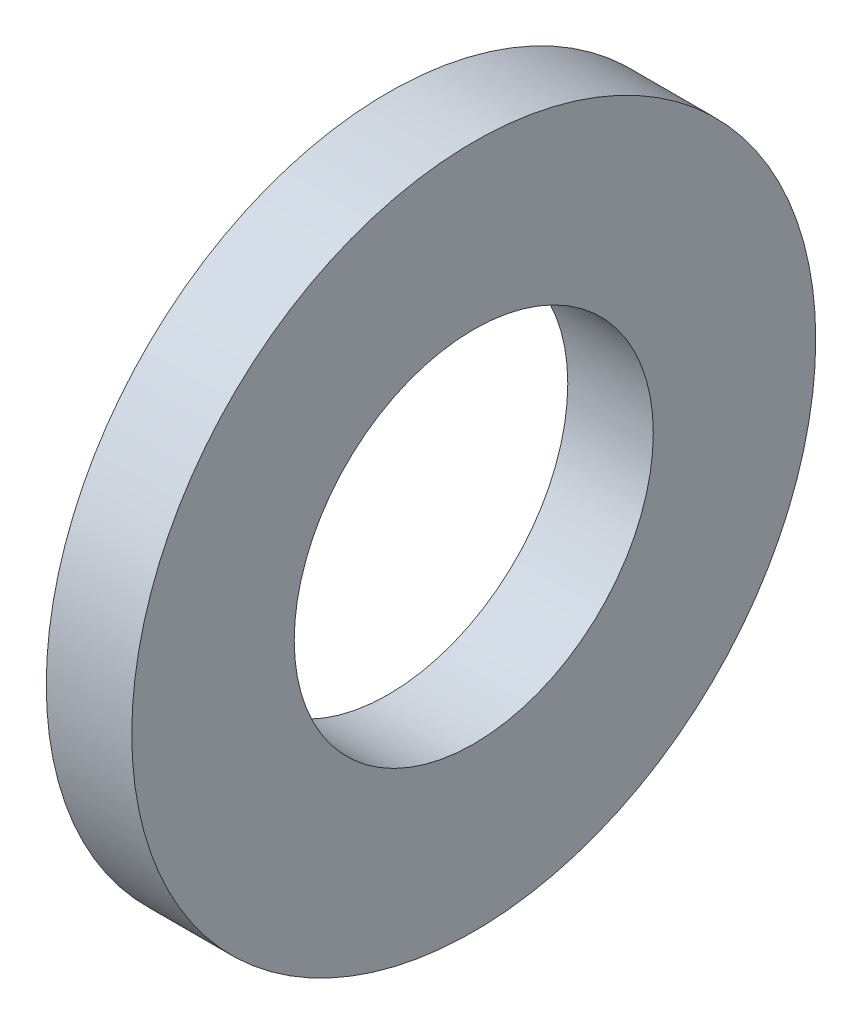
ISO-10303-21;
HEADER;
FILE_DESCRIPTION(('STEP AP214'),'2;1');
FILE_NAME('part.step','',(''),(''),'','','');
FILE_SCHEMA(('AUTOMOTIVE_DESIGN { 1 0 10303 214 1 1 1 1 }'));
ENDSEC;
DATA;
#1=APPLICATION_CONTEXT('core data for automotive mechanical design processes');
#2=APPLICATION_PROTOCOL_DEFINITION('international standard','automotive_design',2000,#1);
#3=PRODUCT_CONTEXT('',#1,'mechanical');
#4=PRODUCT('Part','Part','',(#3));
#5=PRODUCT_RELATED_PRODUCT_CATEGORY('part','',(#4));
#6=PRODUCT_DEFINITION_FORMATION('','',#4);
#7=PRODUCT_DEFINITION_CONTEXT('part definition',#1,'design');
#8=PRODUCT_DEFINITION('design','',#6,#7);
#9=PRODUCT_DEFINITION_SHAPE('','',#8);
#10=(LENGTH_UNIT() NAMED_UNIT(*) SI_UNIT(.MILLI.,.METRE.));
#11=(NAMED_UNIT(*) PLANE_ANGLE_UNIT() SI_UNIT($,.RADIAN.));
#12=(NAMED_UNIT(*) SI_UNIT($,.STERADIAN.) SOLID_ANGLE_UNIT());
#13=UNCERTAINTY_MEASURE_WITH_UNIT(LENGTH_MEASURE(1.E-05),#10,'distance_accuracy_value','');
#14=(GEOMETRIC_REPRESENTATION_CONTEXT(3) GLOBAL_UNCERTAINTY_ASSIGNED_CONTEXT((#13)) GLOBAL_UNIT_ASSIGNED_CONTEXT((#10,
#11,#12)) REPRESENTATION_CONTEXT('',''));
#15=CARTESIAN_POINT('',(0.,0.,0.));
#16=DIRECTION('',(0.,0.,1.));
#17=DIRECTION('',(1.,0.,0.));
#18=AXIS2_PLACEMENT_3D('',#15,#16,#17);
#19=CARTESIAN_POINT('',(-7.4558363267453,0.,0.));
#20=DIRECTION('',(-1.,0.,0.));
#21=DIRECTION('',(0.,0.,1.));
#22=AXIS2_PLACEMENT_3D('',#19,#20,#21);
#23=CYLINDRICAL_SURFACE('',#22,4.20000000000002);
#24=CARTESIAN_POINT('',(2.,0.,0.));
#25=DIRECTION('',(-1.,0.,0.));
#26=DIRECTION('',(0.,0.,1.));
#27=AXIS2_PLACEMENT_3D('',#24,#25,#26);
#28=CIRCLE('',#27,4.20000000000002);
#29=CARTESIAN_POINT('',(2.,0.,4.20000000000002));
#30=VERTEX_POINT('',#29);
#31=EDGE_CURVE('E10',#30,#30,#28,.T.);
#32=ORIENTED_EDGE('',*,*,#31,.F.);
#33=EDGE_LOOP('',(#32));
#34=FACE_BOUND('',#33,.T.);
#35=CARTESIAN_POINT('',(0.,0.,0.));
#36=DIRECTION('',(-1.,0.,0.));
#37=DIRECTION('',(0.,0.,1.));
#38=AXIS2_PLACEMENT_3D('',#35,#36,#37);
#39=CIRCLE('',#38,4.20000000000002);
#40=CARTESIAN_POINT('',(0.,0.,4.20000000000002));
#41=VERTEX_POINT('',#40);
#42=EDGE_CURVE('E43',#41,#41,#39,.T.);
#43=ORIENTED_EDGE('',*,*,#42,.T.);
#44=EDGE_LOOP('',(#43));
#45=FACE_BOUND('',#44,.T.);
#46=ADVANCED_FACE('F29',(#34,#45),#23,.F.);
#47=CARTESIAN_POINT('',(2.,4.20000000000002,0.));
#48=DIRECTION('',(-1.,0.,0.));
#49=DIRECTION('',(0.,0.,1.));
#50=AXIS2_PLACEMENT_3D('',#47,#48,#49);
#51=PLANE('',#50);
#52=CARTESIAN_POINT('',(2.,0.,0.));
#53=DIRECTION('',(-1.,0.,0.));
#54=DIRECTION('',(0.,0.,1.));
#55=AXIS2_PLACEMENT_3D('',#52,#53,#54);
#56=CIRCLE('',#55,8.);
#57=CARTESIAN_POINT('',(2.,0.,8.));
#58=VERTEX_POINT('',#57);
#59=EDGE_CURVE('E35',#58,#58,#56,.T.);
#60=ORIENTED_EDGE('',*,*,#59,.F.);
#61=EDGE_LOOP('',(#60));
#62=FACE_BOUND('',#61,.T.);
#63=ORIENTED_EDGE('',*,*,#31,.T.);
#64=EDGE_LOOP('',(#63));
#65=FACE_BOUND('',#64,.T.);
#66=ADVANCED_FACE('F58',(#62,#65),#51,.F.);
#67=CARTESIAN_POINT('',(-7.4558363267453,0.,0.));
#68=DIRECTION('',(-1.,0.,0.));
#69=DIRECTION('',(0.,0.,1.));
#70=AXIS2_PLACEMENT_3D('',#67,#68,#69);
#71=CYLINDRICAL_SURFACE('',#70,8.);
#72=CARTESIAN_POINT('',(0.,0.,0.));
#73=DIRECTION('',(-1.,0.,0.));
#74=DIRECTION('',(0.,0.,1.));
#75=AXIS2_PLACEMENT_3D('',#72,#73,#74);
#76=CIRCLE('',#75,8.);
#77=CARTESIAN_POINT('',(0.,0.,8.));
#78=VERTEX_POINT('',#77);
#79=EDGE_CURVE('E39',#78,#78,#76,.T.);
#80=ORIENTED_EDGE('',*,*,#79,.F.);
#81=EDGE_LOOP('',(#80));
#82=FACE_BOUND('',#81,.T.);
#83=ORIENTED_EDGE('',*,*,#59,.T.);
#84=EDGE_LOOP('',(#83));
#85=FACE_BOUND('',#84,.T.);
#86=ADVANCED_FACE('F53',(#82,#85),#71,.T.);
#87=CARTESIAN_POINT('',(0.,8.,0.));
#88=DIRECTION('',(1.,0.,0.));
#89=DIRECTION('',(0.,0.,-1.));
#90=AXIS2_PLACEMENT_3D('',#87,#88,#89);
#91=PLANE('',#90);
#92=ORIENTED_EDGE('',*,*,#42,.F.);
#93=EDGE_LOOP('',(#92));
#94=FACE_BOUND('',#93,.T.);
#95=ORIENTED_EDGE('',*,*,#79,.T.);
#96=EDGE_LOOP('',(#95));
#97=FACE_BOUND('',#96,.T.);
#98=ADVANCED_FACE('F50',(#94,#97),#91,.F.);
#99=CLOSED_SHELL('',(#46,#66,#86,#98));
#100=MANIFOLD_SOLID_BREP('B2',#99);
#101=ADVANCED_BREP_SHAPE_REPRESENTATION('',(#18,#100),#14);
#102=SHAPE_DEFINITION_REPRESENTATION(#9,#101);
ENDSEC;
END-ISO-10303-21;
